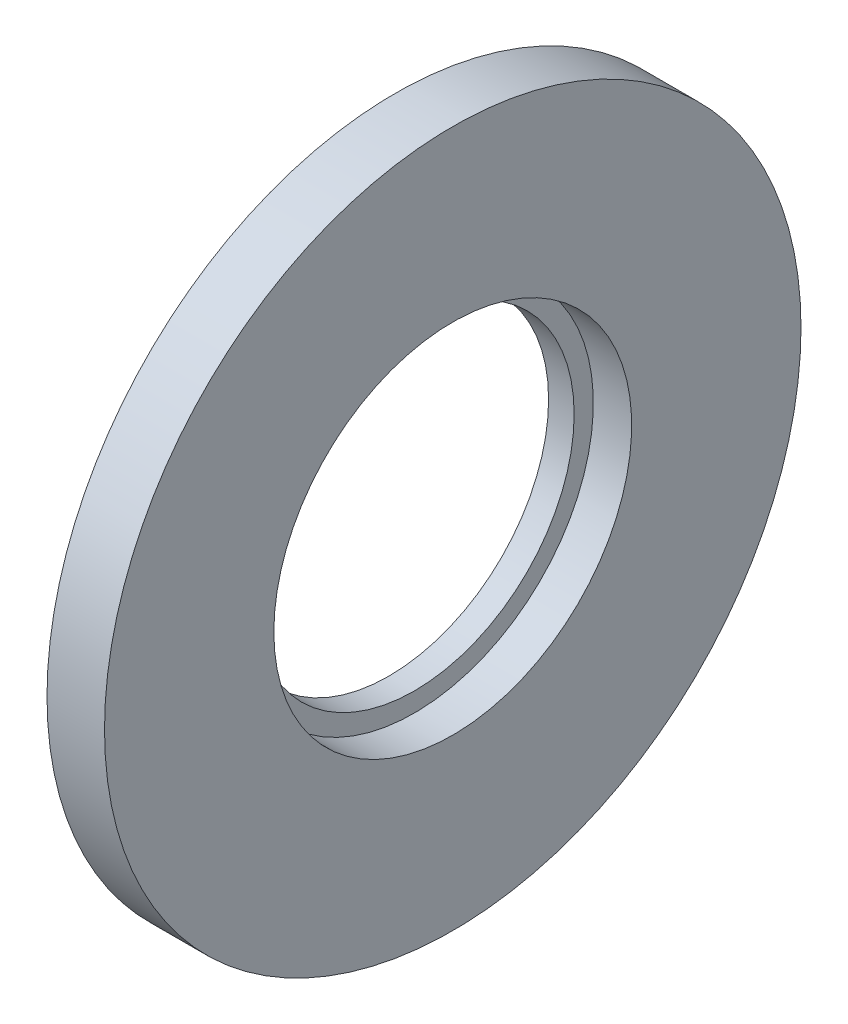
ISO-10303-21;
HEADER;
FILE_DESCRIPTION(('STEP AP214'),'2;1');
FILE_NAME('part.step','',(''),(''),'','','');
FILE_SCHEMA(('AUTOMOTIVE_DESIGN { 1 0 10303 214 1 1 1 1 }'));
ENDSEC;
DATA;
#1=APPLICATION_CONTEXT('core data for automotive mechanical design processes');
#2=APPLICATION_PROTOCOL_DEFINITION('international standard','automotive_design',2000,#1);
#3=PRODUCT_CONTEXT('',#1,'mechanical');
#4=PRODUCT('Part','Part','',(#3));
#5=PRODUCT_RELATED_PRODUCT_CATEGORY('part','',(#4));
#6=PRODUCT_DEFINITION_FORMATION('','',#4);
#7=PRODUCT_DEFINITION_CONTEXT('part definition',#1,'design');
#8=PRODUCT_DEFINITION('design','',#6,#7);
#9=PRODUCT_DEFINITION_SHAPE('','',#8);
#10=(LENGTH_UNIT() NAMED_UNIT(*) SI_UNIT(.MILLI.,.METRE.));
#11=(NAMED_UNIT(*) PLANE_ANGLE_UNIT() SI_UNIT($,.RADIAN.));
#12=(NAMED_UNIT(*) SI_UNIT($,.STERADIAN.) SOLID_ANGLE_UNIT());
#13=UNCERTAINTY_MEASURE_WITH_UNIT(LENGTH_MEASURE(1.E-05),#10,'distance_accuracy_value','');
#14=(GEOMETRIC_REPRESENTATION_CONTEXT(3) GLOBAL_UNCERTAINTY_ASSIGNED_CONTEXT((#13)) GLOBAL_UNIT_ASSIGNED_CONTEXT((#10,
#11,#12)) REPRESENTATION_CONTEXT('',''));
#15=CARTESIAN_POINT('',(0.,0.,0.));
#16=DIRECTION('',(0.,0.,1.));
#17=DIRECTION('',(1.,0.,0.));
#18=AXIS2_PLACEMENT_3D('',#15,#16,#17);
#19=CARTESIAN_POINT('',(-11.1918001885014,0.,0.));
#20=DIRECTION('',(-1.,0.,0.));
#21=DIRECTION('',(0.,0.,1.));
#22=AXIS2_PLACEMENT_3D('',#19,#20,#21);
#23=CYLINDRICAL_SURFACE('',#22,25.);
#24=CARTESIAN_POINT('',(4.,0.,0.));
#25=DIRECTION('',(-1.,0.,0.));
#26=DIRECTION('',(0.,0.,1.));
#27=AXIS2_PLACEMENT_3D('',#24,#25,#26);
#28=CIRCLE('',#27,25.);
#29=CARTESIAN_POINT('',(4.,0.,25.));
#30=VERTEX_POINT('',#29);
#31=EDGE_CURVE('E476',#30,#30,#28,.T.);
#32=ORIENTED_EDGE('',*,*,#31,.F.);
#33=EDGE_LOOP('',(#32));
#34=FACE_BOUND('',#33,.T.);
#35=CARTESIAN_POINT('',(0.,0.,0.));
#36=DIRECTION('',(-1.,0.,0.));
#37=DIRECTION('',(0.,0.,1.));
#38=AXIS2_PLACEMENT_3D('',#35,#36,#37);
#39=CIRCLE('',#38,25.);
#40=CARTESIAN_POINT('',(0.,0.,25.));
#41=VERTEX_POINT('',#40);
#42=EDGE_CURVE('E10',#41,#41,#39,.T.);
#43=ORIENTED_EDGE('',*,*,#42,.T.);
#44=EDGE_LOOP('',(#43));
#45=FACE_BOUND('',#44,.T.);
#46=ADVANCED_FACE('F448',(#34,#45),#23,.F.);
#47=CARTESIAN_POINT('',(0.,25.,0.));
#48=DIRECTION('',(1.,0.,0.));
#49=DIRECTION('',(0.,0.,-1.));
#50=AXIS2_PLACEMENT_3D('',#47,#48,#49);
#51=PLANE('',#50);
#52=ORIENTED_EDGE('',*,*,#42,.F.);
#53=EDGE_LOOP('',(#52));
#54=FACE_BOUND('',#53,.T.);
#55=CARTESIAN_POINT('',(0.,0.,0.));
#56=DIRECTION('',(-1.,0.,0.));
#57=DIRECTION('',(0.,0.,1.));
#58=AXIS2_PLACEMENT_3D('',#55,#56,#57);
#59=CIRCLE('',#58,30.);
#60=CARTESIAN_POINT('',(0.,0.,30.));
#61=VERTEX_POINT('',#60);
#62=EDGE_CURVE('E454',#61,#61,#59,.T.);
#63=ORIENTED_EDGE('',*,*,#62,.T.);
#64=EDGE_LOOP('',(#63));
#65=FACE_BOUND('',#64,.T.);
#66=ADVANCED_FACE('F483',(#54,#65),#51,.F.);
#67=CARTESIAN_POINT('',(-11.1918001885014,0.,0.));
#68=DIRECTION('',(-1.,0.,0.));
#69=DIRECTION('',(0.,0.,1.));
#70=AXIS2_PLACEMENT_3D('',#67,#68,#69);
#71=CYLINDRICAL_SURFACE('',#70,30.);
#72=ORIENTED_EDGE('',*,*,#62,.F.);
#73=EDGE_LOOP('',(#72));
#74=FACE_BOUND('',#73,.T.);
#75=CARTESIAN_POINT('',(1.,0.,0.));
#76=DIRECTION('',(-1.,0.,0.));
#77=DIRECTION('',(0.,0.,1.));
#78=AXIS2_PLACEMENT_3D('',#75,#76,#77);
#79=CIRCLE('',#78,30.);
#80=CARTESIAN_POINT('',(1.,0.,30.));
#81=VERTEX_POINT('',#80);
#82=EDGE_CURVE('E458',#81,#81,#79,.T.);
#83=ORIENTED_EDGE('',*,*,#82,.T.);
#84=EDGE_LOOP('',(#83));
#85=FACE_BOUND('',#84,.T.);
#86=ADVANCED_FACE('F487',(#74,#85),#71,.T.);
#87=CARTESIAN_POINT('',(1.,30.,0.));
#88=DIRECTION('',(1.,0.,0.));
#89=DIRECTION('',(0.,0.,-1.));
#90=AXIS2_PLACEMENT_3D('',#87,#88,#89);
#91=PLANE('',#90);
#92=ORIENTED_EDGE('',*,*,#82,.F.);
#93=EDGE_LOOP('',(#92));
#94=FACE_BOUND('',#93,.T.);
#95=CARTESIAN_POINT('',(1.,0.,0.));
#96=DIRECTION('',(-1.,0.,0.));
#97=DIRECTION('',(0.,0.,1.));
#98=AXIS2_PLACEMENT_3D('',#95,#96,#97);
#99=CIRCLE('',#98,54.5);
#100=CARTESIAN_POINT('',(1.,0.,54.5));
#101=VERTEX_POINT('',#100);
#102=EDGE_CURVE('E462',#101,#101,#99,.T.);
#103=ORIENTED_EDGE('',*,*,#102,.T.);
#104=EDGE_LOOP('',(#103));
#105=FACE_BOUND('',#104,.T.);
#106=ADVANCED_FACE('F492',(#94,#105),#91,.F.);
#107=CARTESIAN_POINT('',(-11.1918001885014,0.,0.));
#108=DIRECTION('',(-1.,0.,0.));
#109=DIRECTION('',(0.,0.,1.));
#110=AXIS2_PLACEMENT_3D('',#107,#108,#109);
#111=CYLINDRICAL_SURFACE('',#110,54.5);
#112=ORIENTED_EDGE('',*,*,#102,.F.);
#113=EDGE_LOOP('',(#112));
#114=FACE_BOUND('',#113,.T.);
#115=CARTESIAN_POINT('',(10.,0.,0.));
#116=DIRECTION('',(-1.,0.,0.));
#117=DIRECTION('',(0.,0.,1.));
#118=AXIS2_PLACEMENT_3D('',#115,#116,#117);
#119=CIRCLE('',#118,54.5);
#120=CARTESIAN_POINT('',(10.,0.,54.5));
#121=VERTEX_POINT('',#120);
#122=EDGE_CURVE('E467',#121,#121,#119,.T.);
#123=ORIENTED_EDGE('',*,*,#122,.T.);
#124=EDGE_LOOP('',(#123));
#125=FACE_BOUND('',#124,.T.);
#126=ADVANCED_FACE('F498',(#114,#125),#111,.T.);
#127=CARTESIAN_POINT('',(10.,54.5,0.));
#128=DIRECTION('',(-1.,0.,0.));
#129=DIRECTION('',(0.,0.,1.));
#130=AXIS2_PLACEMENT_3D('',#127,#128,#129);
#131=PLANE('',#130);
#132=ORIENTED_EDGE('',*,*,#122,.F.);
#133=EDGE_LOOP('',(#132));
#134=FACE_BOUND('',#133,.T.);
#135=CARTESIAN_POINT('',(10.,0.,0.));
#136=DIRECTION('',(-1.,0.,0.));
#137=DIRECTION('',(0.,0.,1.));
#138=AXIS2_PLACEMENT_3D('',#135,#136,#137);
#139=CIRCLE('',#138,28.);
#140=CARTESIAN_POINT('',(10.,0.,28.));
#141=VERTEX_POINT('',#140);
#142=EDGE_CURVE('E470',#141,#141,#139,.T.);
#143=ORIENTED_EDGE('',*,*,#142,.T.);
#144=EDGE_LOOP('',(#143));
#145=FACE_BOUND('',#144,.T.);
#146=ADVANCED_FACE('F502',(#134,#145),#131,.F.);
#147=CARTESIAN_POINT('',(-11.1918001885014,0.,0.));
#148=DIRECTION('',(-1.,0.,0.));
#149=DIRECTION('',(0.,0.,1.));
#150=AXIS2_PLACEMENT_3D('',#147,#148,#149);
#151=CYLINDRICAL_SURFACE('',#150,28.);
#152=ORIENTED_EDGE('',*,*,#142,.F.);
#153=EDGE_LOOP('',(#152));
#154=FACE_BOUND('',#153,.T.);
#155=CARTESIAN_POINT('',(4.,0.,0.));
#156=DIRECTION('',(-1.,0.,0.));
#157=DIRECTION('',(0.,0.,1.));
#158=AXIS2_PLACEMENT_3D('',#155,#156,#157);
#159=CIRCLE('',#158,28.);
#160=CARTESIAN_POINT('',(4.,0.,28.));
#161=VERTEX_POINT('',#160);
#162=EDGE_CURVE('E473',#161,#161,#159,.T.);
#163=ORIENTED_EDGE('',*,*,#162,.T.);
#164=EDGE_LOOP('',(#163));
#165=FACE_BOUND('',#164,.T.);
#166=ADVANCED_FACE('F506',(#154,#165),#151,.F.);
#167=CARTESIAN_POINT('',(4.,25.,0.));
#168=DIRECTION('',(-1.,0.,0.));
#169=DIRECTION('',(0.,0.,1.));
#170=AXIS2_PLACEMENT_3D('',#167,#168,#169);
#171=PLANE('',#170);
#172=ORIENTED_EDGE('',*,*,#162,.F.);
#173=EDGE_LOOP('',(#172));
#174=FACE_BOUND('',#173,.T.);
#175=ORIENTED_EDGE('',*,*,#31,.T.);
#176=EDGE_LOOP('',(#175));
#177=FACE_BOUND('',#176,.T.);
#178=ADVANCED_FACE('F480',(#174,#177),#171,.F.);
#179=CLOSED_SHELL('',(#46,#66,#86,#106,#126,#146,#166,#178));
#180=MANIFOLD_SOLID_BREP('B2',#179);
#181=ADVANCED_BREP_SHAPE_REPRESENTATION('',(#18,#180),#14);
#182=SHAPE_DEFINITION_REPRESENTATION(#9,#181);
ENDSEC;
END-ISO-10303-21;
